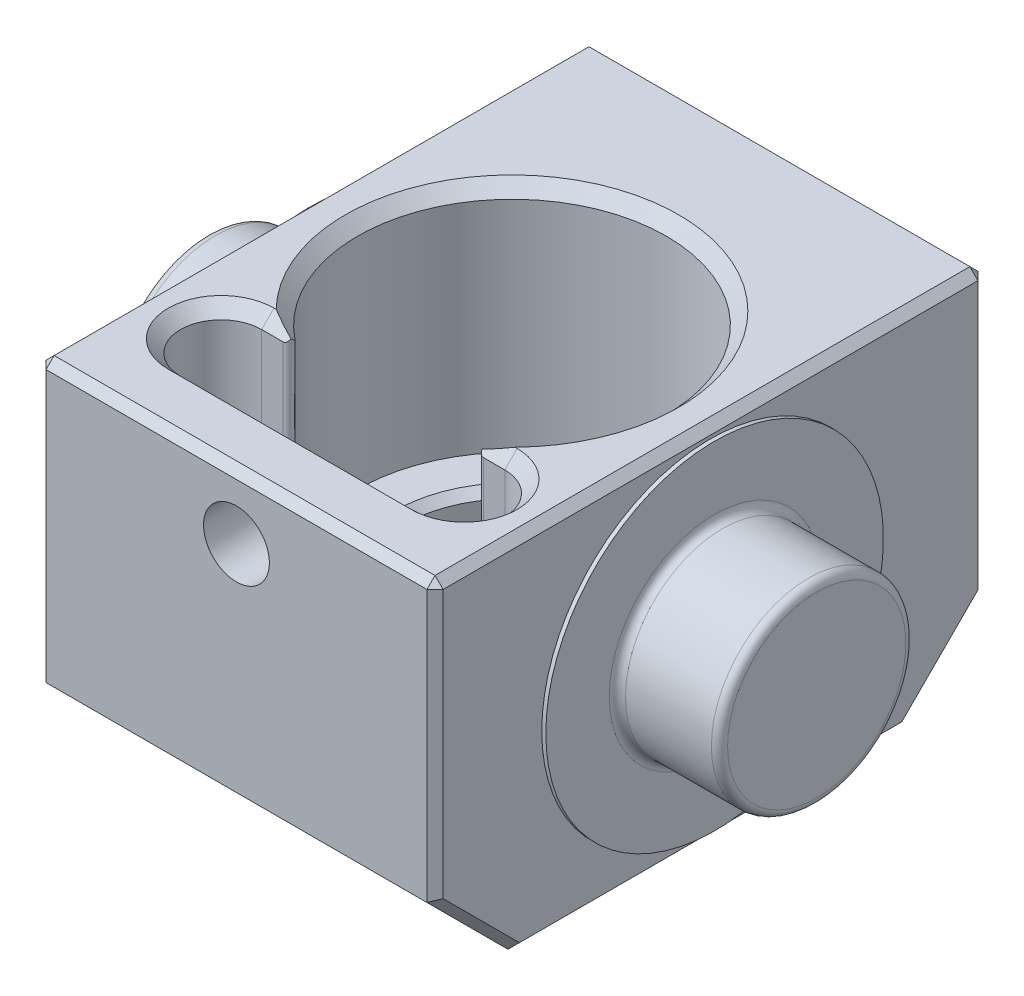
from build123d import *

# Parameters (mm, degrees)
SKETCH1_W           = 34
SKETCH1_H           = 22.225
BOSS_EXTRUDE1_DEPTH = 12.25
SKETCH3_W           = 9.52881
SKETCH3_H           = 14.2875
SKETCH4_W           = 6.731
SKETCH4_H           = 7.9375
CUT_EXTRUDE1_DEPTH  = 6.5
CHAMFER1_SIZE       = 5
CHAMFER2_SIZE       = 0.5
CHAMFER4_SIZE       = 0.762
FILLET1_R           = 0.3
CHAMFER5_SIZE       = 0.5
FILLET2_R           = 0.500000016
FILLET3_R           = 0.500000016
CUT_EXTRUDE2_REACH  = 42.409
SKETCH9_R           = 2.032


with BuildPart() as part:
    # Sketch1 → Boss-Extrude1 (new, symmetric)
    with BuildSketch(Plane(origin=(0, 0, 0), x_dir=(0, 0, -1), z_dir=(1, 0, 0))):
        Rectangle(SKETCH1_W, SKETCH1_H)
    extrude(amount=BOSS_EXTRUDE1_DEPTH, both=True)

    # Sketch2 → Revolve1 (revolve)
    with BuildSketch(Plane.XY, mode=Mode.PRIVATE) as revolve1_sk:
        Polygon((12.25, 10.414), (12.5, 10.414), (12.5, 6), (18.8, 6), (18.8, 0), (12.25, 0), align=None)
    revolve1 = revolve(revolve1_sk.sketch.rotate(Axis((0, 0, 0), (1, 0, 0)), 90), axis=Axis((0, 0, 0), (1, 0, 0)))

    # Mirror1: Revolve1 across plane
    add(revolve1.mirror(Plane(origin=(0, 0, 0), x_dir=(0, 0, 1), z_dir=(1, 0, 0))))

    # Sketch3 → Cut-Revolve1 (revolve, cut)
    with BuildSketch(Plane.XY, mode=Mode.PRIVATE) as cut_revolve1_sk:
        with Locations((-4.764405, 3.96875)):
            Rectangle(SKETCH3_W, SKETCH3_H)
    revolve(cut_revolve1_sk.sketch.rotate(Axis((0, 10.124682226, 0), (0, -1, 0)), 270), axis=Axis((0, 10.124682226, 0), (0, -1, 0)), mode=Mode.SUBTRACT)

    # Sketch4 → Cut-Revolve2 (revolve, cut)
    with BuildSketch(Plane.XY, mode=Mode.PRIVATE) as cut_revolve2_sk:
        with Locations((-3.3655, -7.14375)):
            Rectangle(SKETCH4_W, SKETCH4_H)
    revolve(cut_revolve2_sk.sketch.rotate(Axis((0, -1.925213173, 0), (0, -1, 0)), 270), axis=Axis((0, -1.925213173, 0), (0, -1, 0)), mode=Mode.SUBTRACT)

    # Sketch5 → Cut-Extrude1 (cut)
    with BuildSketch(Plane(origin=(0, 11.1125, 0), x_dir=(1, 0, 0), z_dir=(0, 1, 0))):
        with BuildLine():
            Line((-7.5, -7.94639), (7.5, -7.94639))
            ThreePointArc((7.5, -7.94639), (10, -10.44639), (7.5, -12.94639))
            Line((7.5, -12.94639), (-7.5, -12.94639))
            ThreePointArc((-7.5, -12.94639), (-10, -10.44639), (-7.5, -7.94639))
        make_face()
    extrude(amount=-CUT_EXTRUDE1_DEPTH, mode=Mode.SUBTRACT)

    # Chamfer1
    chamfer1_edges = [part.edges().sort_by_distance(p)[0] for p in [
        (0, -11.1125, -17),
        (0, -11.1125, 17),
    ]]
    chamfer(chamfer1_edges, length=CHAMFER1_SIZE)

    # Chamfer2
    chamfer2_edges = [part.edges().sort_by_distance(p)[0] for p in [
        (12.25, 2.5, 17),
        (-12.25, 2.5, 17),
        (-12.25, 2.5, -17),
        (12.25, 2.5, -17),
        (-12.25, -11.1125, 0),
        (-12.25, 11.1125, 0),
        (-12.25, -8.6125, 14.5),
        (-12.25, -8.6125, -14.5),
        (12.25, -11.1125, 0),
        (12.25, -8.6125, 14.5),
        (12.25, -8.6125, -14.5),
        (12.25, 11.1125, 0),
        (0, 11.1125, 17),
        (0, 11.1125, -17),
    ]]
    chamfer(chamfer2_edges, length=CHAMFER2_SIZE)

    # Chamfer4
    chamfer4_edges = [part.edges().sort_by_distance(p)[0] for p in [
        (0, 11.1125, -9.52881),
        (6.379311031, 11.1125, 7.94639),
        (-6.379311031, 11.1125, 7.94639),
        (-10, 11.1125, 10.44639),
        (0, 11.1125, 12.94639),
        (10, 11.1125, 10.44639),
    ]]
    chamfer(chamfer4_edges, length=CHAMFER4_SIZE)

    # Fillet1
    fillet1_edges = [part.edges().sort_by_distance(p)[0] for p in [
        (5.258622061, 7.4815, 7.94639),
        (-5.258622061, 7.4815, 7.94639),
    ]]
    fillet(fillet1_edges, radius=FILLET1_R)

    # Chamfer5
    chamfer5_edges = [part.edges().sort_by_distance(p)[0] for p in [
        (0, -11.1125, -6.731),
        (0, -3.175, -6.731),
    ]]
    chamfer(chamfer5_edges, length=CHAMFER5_SIZE)

    # Fillet2
    fillet2_edges = [part.edges().sort_by_distance(p)[0] for p in [
        (18.8, 0, -6),
        (-18.8, 0, -6),
    ]]
    fillet(fillet2_edges, radius=FILLET2_R)

    # Fillet3
    fillet3_edges = [part.edges().sort_by_distance(p)[0] for p in [
        (12.5, 0, -6),
        (-12.5, 0, -6),
    ]]
    fillet(fillet3_edges, radius=FILLET3_R)

    # Sketch9 → Cut-Extrude2 (cut, up to next)
    with BuildSketch(Plane.XY.offset(17), mode=Mode.PRIVATE) as cut_extrude2_sk1:
        with Locations((0, 7.1725)):
            Circle(SKETCH9_R)
    cut_extrude2_tool1 = extrude(cut_extrude2_sk1.sketch, amount=-CUT_EXTRUDE2_REACH, mode=Mode.PRIVATE) & part.part
    add(cut_extrude2_tool1.solids().sort_by_distance((0, 7.1725, 17))[0], mode=Mode.SUBTRACT)


solid = part.part
